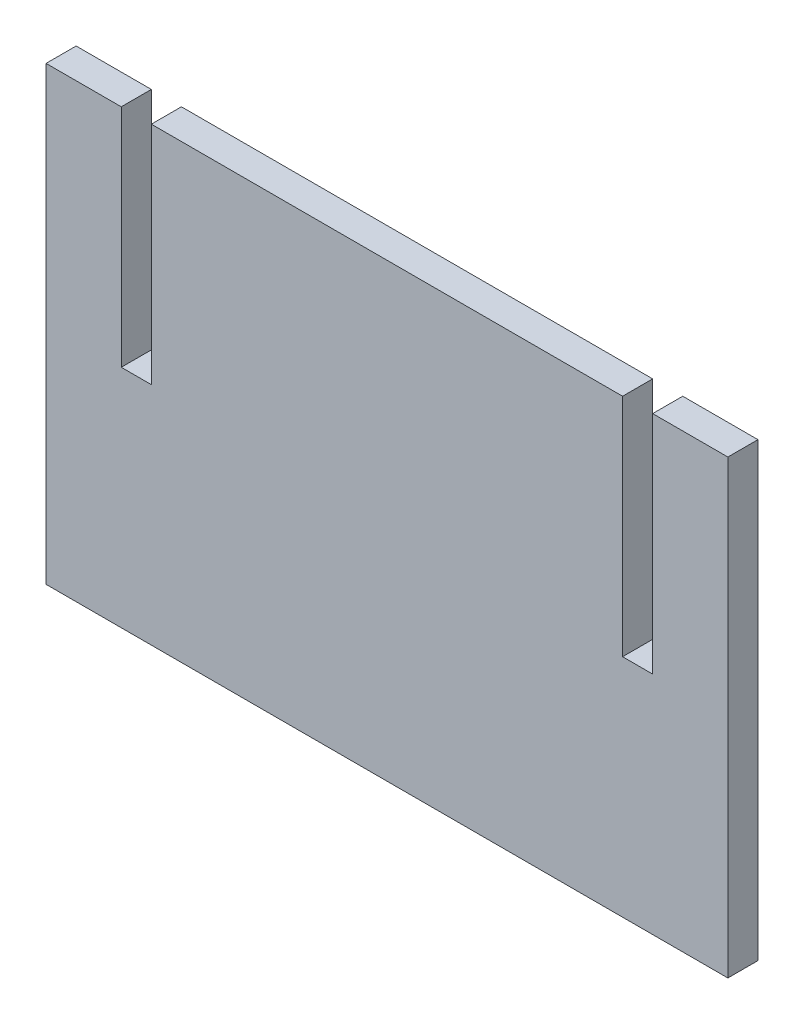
from build123d import *

# Parameters (mm, degrees)
BOSS_EXTRUDE1_DEPTH = 12


with BuildPart() as part:
    # Sketch3 → Boss-Extrude1 (new body)
    with BuildSketch(Plane(origin=(0, 0, 0), x_dir=(0, 1, 0), z_dir=(0, 0, 1))):
        Polygon((0, 106), (90, 106), (90, 136), (-90, 136), (-90, -136), (90, -136), (90, -106), (0, -106), (0, -94), (90, -94), (90, 94), (0, 94), align=None)
    extrude(amount=BOSS_EXTRUDE1_DEPTH)


solid = part.part
